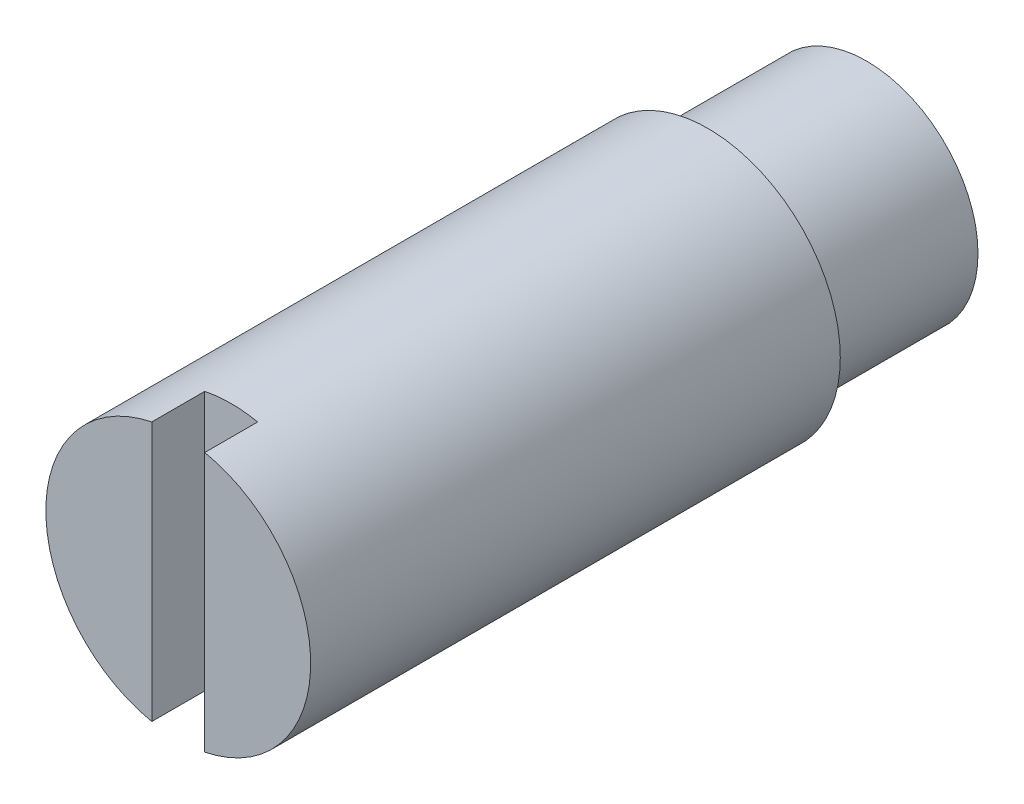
from build123d import *

# Parameters (mm, degrees)
SKETCH1_R      = 2.5
EXTRUDE1_DEPTH = 13
SKETCH2_R      = 3.845183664
SKETCH2_R_2    = 2.1
EXTRUDE2_DEPTH = 3
SKETCH3_W      = 1
SKETCH3_H      = 5
EXTRUDE3_DEPTH = 1


with BuildPart() as part:
    # Sketch1 → Extrude1 (new body)
    with BuildSketch(Plane.XY):
        with Locations(Location((0, 0, 0), (0, 0, 180))):
            Circle(SKETCH1_R)
    extrude(amount=EXTRUDE1_DEPTH)

    # Sketch2 → Extrude2 (cut)
    with BuildSketch(Plane.XY):
        Circle(SKETCH2_R)
        Circle(SKETCH2_R_2, mode=Mode.SUBTRACT)
    extrude(amount=EXTRUDE2_DEPTH, mode=Mode.SUBTRACT)

    # Sketch3 → Extrude3 (cut)
    with BuildSketch(Plane.XY.offset(13)):
        Rectangle(SKETCH3_W, SKETCH3_H)
    extrude(amount=-EXTRUDE3_DEPTH, mode=Mode.SUBTRACT)


solid = part.part
